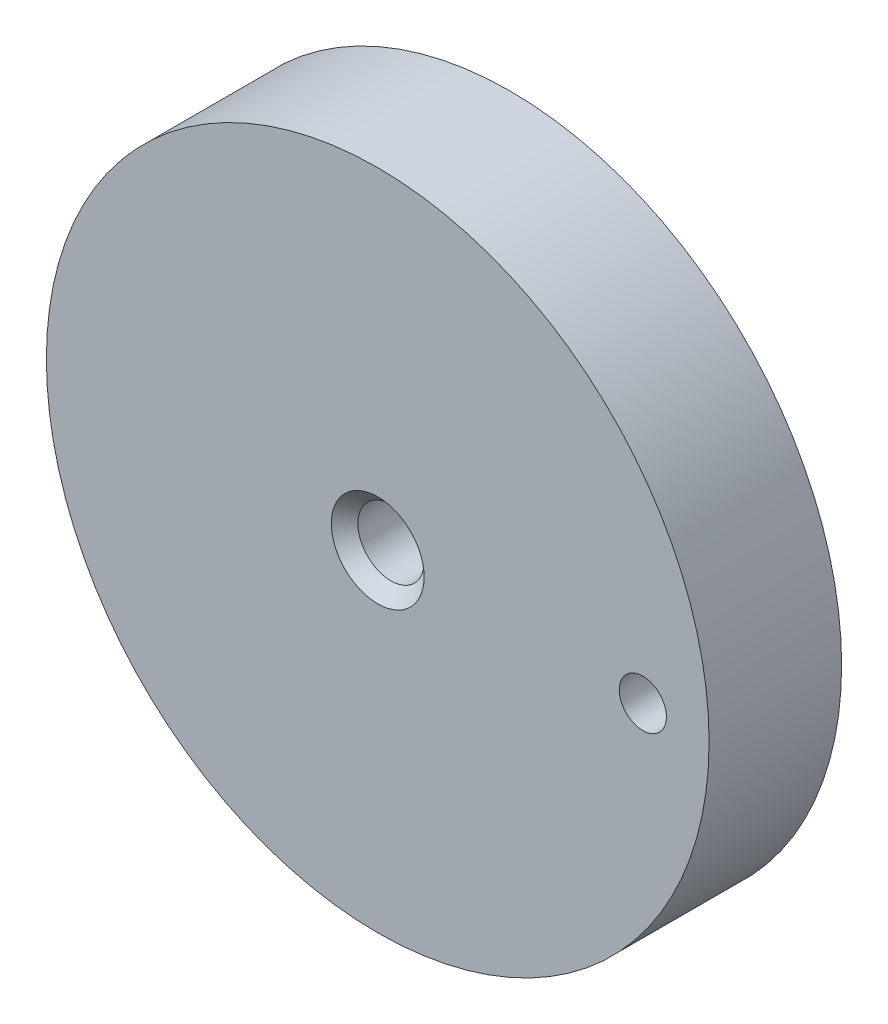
from build123d import *

# Parameters (mm, degrees)
SKETCH1_R                  = 6.35
EXTRUDE1_DEPTH             = 6.35
SKETCH2_R                  = 15.875
EXTRUDE2_DEPTH             = 6.35
SKETCH8_R                  = 1.5875
EXTRUDE3_DEPTH             = 12.7
F_4_40_TAPPED_HOLE2_REACH  = 30.926
F_4_40_TAPPED_HOLE2_BORE_R = 1.1303
CHAMFER1_SIZE              = 0.635
F_4_40_TAPPED_HOLE3_D      = 2.2606
F_4_40_TAPPED_HOLE3_DEPTH  = 19.05
F_4_40_TAPPED_HOLE3_TIP    = 0.679152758


with BuildPart() as part:
    # Sketch1 → Extrude1 (new body)
    with BuildSketch(Plane.XY):
        Circle(SKETCH1_R)
    extrude(amount=EXTRUDE1_DEPTH)

    # Sketch2 → Extrude2 (add)
    with BuildSketch(Plane.XY.offset(6.35)):
        Circle(SKETCH2_R)
    extrude(amount=EXTRUDE2_DEPTH)

    # Sketch8 → Extrude3 (cut)
    with BuildSketch(Plane(origin=(0, 0, 0), x_dir=(-1, 0, 0), z_dir=(0, 0, -1))):
        Circle(SKETCH8_R)
    extrude(amount=-EXTRUDE3_DEPTH, mode=Mode.SUBTRACT)

    # 4-40 Tapped Hole2 bore → 4-40 Tapped Hole2 (cut, up to next)
    with BuildSketch(Plane(origin=(0, -6.35, 3.175), x_dir=(-1, 0, 0), z_dir=(0, -1, 0)), mode=Mode.PRIVATE) as f_4_40_tapped_hole2_sk1:
        with Locations((0, -0.027509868)):
            Circle(F_4_40_TAPPED_HOLE2_BORE_R)
    f_4_40_tapped_hole2_tool1 = extrude(f_4_40_tapped_hole2_sk1.sketch, amount=-F_4_40_TAPPED_HOLE2_REACH, mode=Mode.PRIVATE) & part.part
    add(f_4_40_tapped_hole2_tool1.solids().sort_by_distance((0, -6.35, 3.20251))[0], mode=Mode.SUBTRACT)

    # Chamfer1
    chamfer1_edges = [part.edges().sort_by_distance(p)[0] for p in [
        (1.5875, 0, 12.7),
    ]]
    chamfer(chamfer1_edges, length=CHAMFER1_SIZE)

    # 4-40 Tapped Hole3
    with Locations(Plane.XY.offset(12.7)):
        with Locations((12.7, 0)):
            Hole(F_4_40_TAPPED_HOLE3_D / 2, depth=F_4_40_TAPPED_HOLE3_DEPTH)
            with Locations((0, 0, -(F_4_40_TAPPED_HOLE3_DEPTH + F_4_40_TAPPED_HOLE3_TIP / 2))):  # 118° drill point
                Cone(0, F_4_40_TAPPED_HOLE3_D / 2, F_4_40_TAPPED_HOLE3_TIP, mode=Mode.SUBTRACT)


solid = part.part
